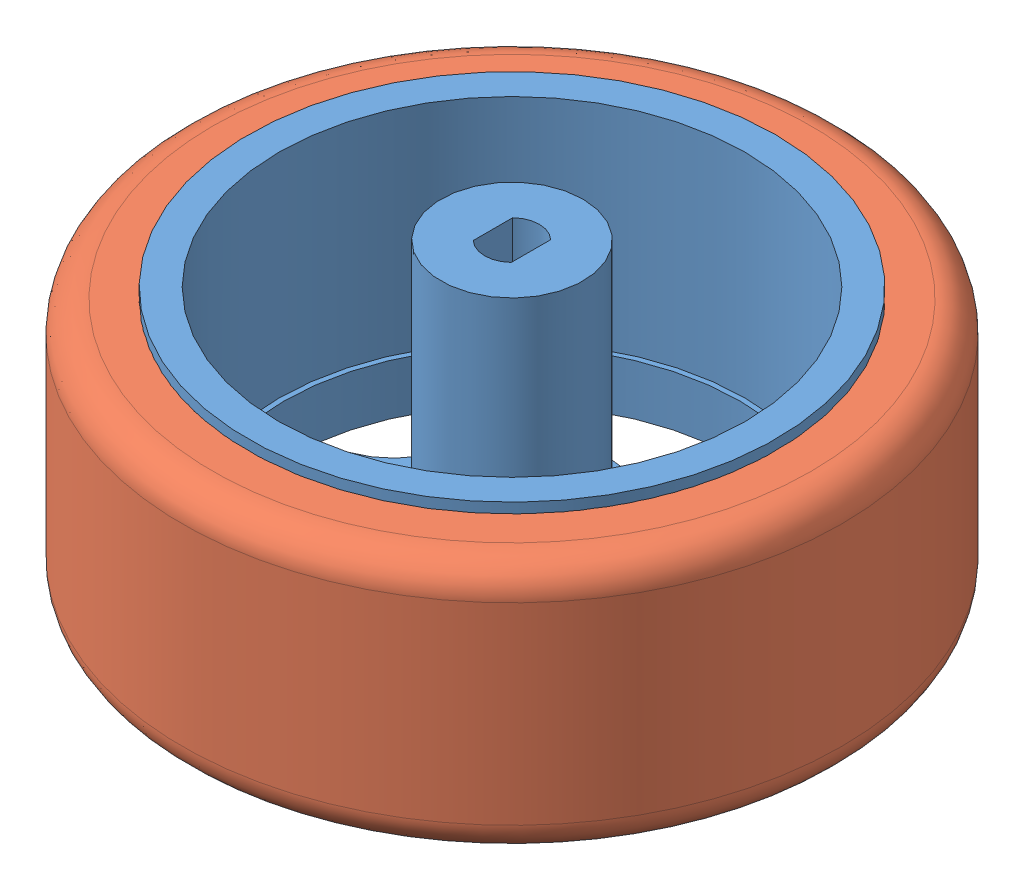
SolidWorks assembly wheel.SLDASM, configuration Default (file format 10000). Lengths in mm.
Overall size (65 30.24 65).
2 component instances, 2 part files, 0 mates.
Components (placement in the parent):
- rim-1: rim.sldprt [Default] at origin size (52 30.24 52)
- tire-1: tire.sldprt [Default] at (0 12.5 0) x (1 0 0) z (0 -1 0) size (65 65 25)
